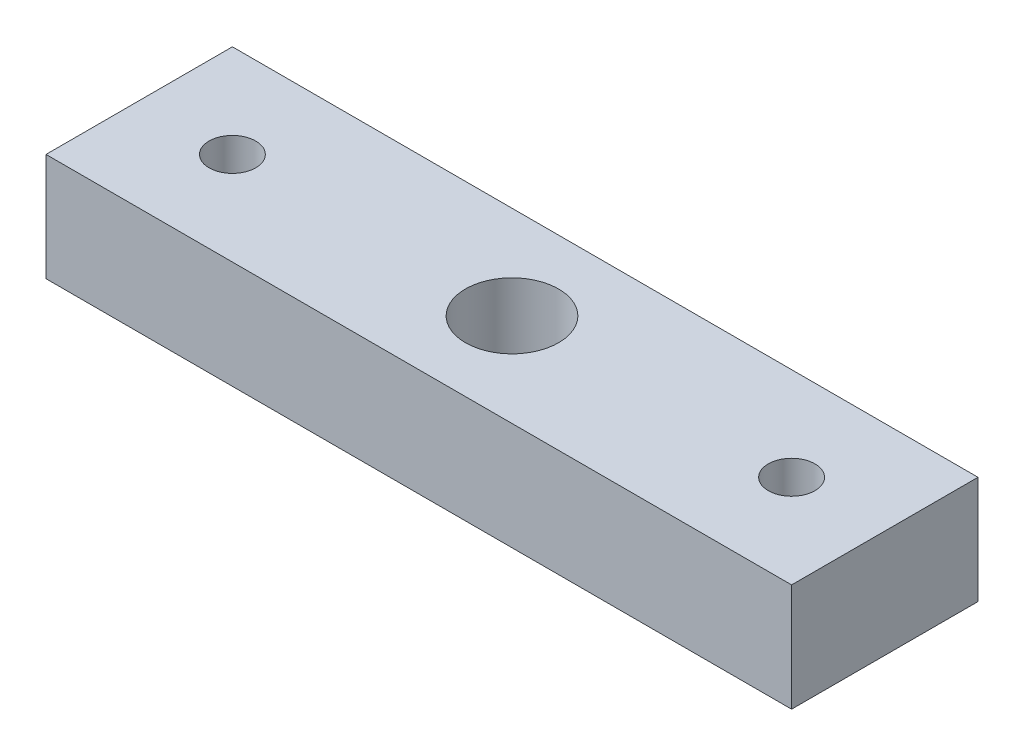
ISO-10303-21;
HEADER;
FILE_DESCRIPTION(('STEP AP214'),'2;1');
FILE_NAME('part.step','',(''),(''),'','','');
FILE_SCHEMA(('AUTOMOTIVE_DESIGN { 1 0 10303 214 1 1 1 1 }'));
ENDSEC;
DATA;
#1=APPLICATION_CONTEXT('core data for automotive mechanical design processes');
#2=APPLICATION_PROTOCOL_DEFINITION('international standard','automotive_design',2000,#1);
#3=PRODUCT_CONTEXT('',#1,'mechanical');
#4=PRODUCT('Part','Part','',(#3));
#5=PRODUCT_RELATED_PRODUCT_CATEGORY('part','',(#4));
#6=PRODUCT_DEFINITION_FORMATION('','',#4);
#7=PRODUCT_DEFINITION_CONTEXT('part definition',#1,'design');
#8=PRODUCT_DEFINITION('design','',#6,#7);
#9=PRODUCT_DEFINITION_SHAPE('','',#8);
#10=(LENGTH_UNIT() NAMED_UNIT(*) SI_UNIT(.MILLI.,.METRE.));
#11=(NAMED_UNIT(*) PLANE_ANGLE_UNIT() SI_UNIT($,.RADIAN.));
#12=(NAMED_UNIT(*) SI_UNIT($,.STERADIAN.) SOLID_ANGLE_UNIT());
#13=UNCERTAINTY_MEASURE_WITH_UNIT(LENGTH_MEASURE(1.E-05),#10,'distance_accuracy_value','');
#14=(GEOMETRIC_REPRESENTATION_CONTEXT(3) GLOBAL_UNCERTAINTY_ASSIGNED_CONTEXT((#13)) GLOBAL_UNIT_ASSIGNED_CONTEXT((#10,
#11,#12)) REPRESENTATION_CONTEXT('',''));
#15=CARTESIAN_POINT('',(0.,0.,0.));
#16=DIRECTION('',(0.,0.,1.));
#17=DIRECTION('',(1.,0.,0.));
#18=AXIS2_PLACEMENT_3D('',#15,#16,#17);
#19=CARTESIAN_POINT('',(0.,58.6848907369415,0.));
#20=DIRECTION('',(0.,-1.,0.));
#21=DIRECTION('',(0.,0.,-1.));
#22=AXIS2_PLACEMENT_3D('',#19,#20,#21);
#23=PLANE('',#22);
#24=DIRECTION('',(0.,0.,-1.));
#25=VECTOR('',#24,1.);
#26=CARTESIAN_POINT('',(203.2,58.6848907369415,50.8));
#27=LINE('',#26,#25);
#28=CARTESIAN_POINT('',(203.2,58.6848907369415,50.8));
#29=VERTEX_POINT('',#28);
#30=CARTESIAN_POINT('',(203.2,58.6848907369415,-50.8));
#31=VERTEX_POINT('',#30);
#32=EDGE_CURVE('E156',#29,#31,#27,.T.);
#33=ORIENTED_EDGE('',*,*,#32,.T.);
#34=DIRECTION('',(-1.,0.,0.));
#35=VECTOR('',#34,1.);
#36=CARTESIAN_POINT('',(-203.2,58.6848907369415,-50.8));
#37=LINE('',#36,#35);
#38=CARTESIAN_POINT('',(-203.2,58.6848907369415,-50.8));
#39=VERTEX_POINT('',#38);
#40=EDGE_CURVE('E93',#31,#39,#37,.T.);
#41=ORIENTED_EDGE('',*,*,#40,.T.);
#42=DIRECTION('',(0.,0.,1.));
#43=VECTOR('',#42,1.);
#44=CARTESIAN_POINT('',(-203.2,58.6848907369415,50.8));
#45=LINE('',#44,#43);
#46=CARTESIAN_POINT('',(-203.2,58.6848907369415,50.8));
#47=VERTEX_POINT('',#46);
#48=EDGE_CURVE('E157',#39,#47,#45,.T.);
#49=ORIENTED_EDGE('',*,*,#48,.T.);
#50=DIRECTION('',(1.,0.,0.));
#51=VECTOR('',#50,1.);
#52=CARTESIAN_POINT('',(-203.2,58.6848907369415,50.8));
#53=LINE('',#52,#51);
#54=EDGE_CURVE('E58',#47,#29,#53,.T.);
#55=ORIENTED_EDGE('',*,*,#54,.T.);
#56=EDGE_LOOP('',(#33,#41,#49,#55));
#57=FACE_BOUND('',#56,.T.);
#58=CARTESIAN_POINT('',(-152.4,58.6848907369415,0.));
#59=DIRECTION('',(0.,1.,0.));
#60=DIRECTION('',(0.,0.,1.));
#61=AXIS2_PLACEMENT_3D('',#58,#59,#60);
#62=CIRCLE('',#61,12.7);
#63=CARTESIAN_POINT('',(-152.4,58.6848907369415,12.7));
#64=VERTEX_POINT('',#63);
#65=EDGE_CURVE('E147',#64,#64,#62,.T.);
#66=ORIENTED_EDGE('',*,*,#65,.F.);
#67=EDGE_LOOP('',(#66));
#68=FACE_BOUND('',#67,.T.);
#69=CARTESIAN_POINT('',(152.4,58.6848907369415,0.));
#70=DIRECTION('',(0.,1.,0.));
#71=DIRECTION('',(0.,0.,1.));
#72=AXIS2_PLACEMENT_3D('',#69,#70,#71);
#73=CIRCLE('',#72,12.7);
#74=CARTESIAN_POINT('',(152.4,58.6848907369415,12.7));
#75=VERTEX_POINT('',#74);
#76=EDGE_CURVE('E145',#75,#75,#73,.T.);
#77=ORIENTED_EDGE('',*,*,#76,.F.);
#78=EDGE_LOOP('',(#77));
#79=FACE_BOUND('',#78,.T.);
#80=CARTESIAN_POINT('',(0.,58.6848907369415,0.));
#81=DIRECTION('',(0.,1.,0.));
#82=DIRECTION('',(0.,0.,1.));
#83=AXIS2_PLACEMENT_3D('',#80,#81,#82);
#84=CIRCLE('',#83,25.4);
#85=CARTESIAN_POINT('',(0.,58.6848907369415,25.4));
#86=VERTEX_POINT('',#85);
#87=EDGE_CURVE('E137',#86,#86,#84,.T.);
#88=ORIENTED_EDGE('',*,*,#87,.F.);
#89=EDGE_LOOP('',(#88));
#90=FACE_BOUND('',#89,.T.);
#91=ADVANCED_FACE('F43',(#57,#68,#79,#90),#23,.F.);
#92=CARTESIAN_POINT('',(0.,0.,0.));
#93=DIRECTION('',(0.,-1.,0.));
#94=DIRECTION('',(0.,0.,-1.));
#95=AXIS2_PLACEMENT_3D('',#92,#93,#94);
#96=PLANE('',#95);
#97=CARTESIAN_POINT('',(-133.35,0.,0.));
#98=DIRECTION('',(0.,-1.,0.));
#99=DIRECTION('',(0.,0.,-1.));
#100=AXIS2_PLACEMENT_3D('',#97,#98,#99);
#101=CIRCLE('',#100,2.55269999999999);
#102=CARTESIAN_POINT('',(-133.35,0.,-2.55269999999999));
#103=VERTEX_POINT('',#102);
#104=EDGE_CURVE('E113',#103,#103,#101,.T.);
#105=ORIENTED_EDGE('',*,*,#104,.F.);
#106=EDGE_LOOP('',(#105));
#107=FACE_BOUND('',#106,.T.);
#108=CARTESIAN_POINT('',(-171.45,0.,0.));
#109=DIRECTION('',(0.,-1.,0.));
#110=DIRECTION('',(0.,0.,-1.));
#111=AXIS2_PLACEMENT_3D('',#108,#109,#110);
#112=CIRCLE('',#111,2.55269999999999);
#113=CARTESIAN_POINT('',(-171.45,0.,-2.55269999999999));
#114=VERTEX_POINT('',#113);
#115=EDGE_CURVE('E111',#114,#114,#112,.T.);
#116=ORIENTED_EDGE('',*,*,#115,.F.);
#117=EDGE_LOOP('',(#116));
#118=FACE_BOUND('',#117,.T.);
#119=CARTESIAN_POINT('',(133.35,0.,0.));
#120=DIRECTION('',(0.,-1.,0.));
#121=DIRECTION('',(0.,0.,-1.));
#122=AXIS2_PLACEMENT_3D('',#119,#120,#121);
#123=CIRCLE('',#122,2.55269999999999);
#124=CARTESIAN_POINT('',(133.35,0.,-2.55269999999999));
#125=VERTEX_POINT('',#124);
#126=EDGE_CURVE('E124',#125,#125,#123,.T.);
#127=ORIENTED_EDGE('',*,*,#126,.F.);
#128=EDGE_LOOP('',(#127));
#129=FACE_BOUND('',#128,.T.);
#130=CARTESIAN_POINT('',(171.45,0.,0.));
#131=DIRECTION('',(0.,-1.,0.));
#132=DIRECTION('',(0.,0.,-1.));
#133=AXIS2_PLACEMENT_3D('',#130,#131,#132);
#134=CIRCLE('',#133,2.55269999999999);
#135=CARTESIAN_POINT('',(171.45,0.,-2.55269999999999));
#136=VERTEX_POINT('',#135);
#137=EDGE_CURVE('E134',#136,#136,#134,.T.);
#138=ORIENTED_EDGE('',*,*,#137,.F.);
#139=EDGE_LOOP('',(#138));
#140=FACE_BOUND('',#139,.T.);
#141=CARTESIAN_POINT('',(152.4,0.,0.));
#142=DIRECTION('',(0.,1.,0.));
#143=DIRECTION('',(0.,0.,1.));
#144=AXIS2_PLACEMENT_3D('',#141,#142,#143);
#145=CIRCLE('',#144,12.7);
#146=CARTESIAN_POINT('',(152.4,0.,12.7));
#147=VERTEX_POINT('',#146);
#148=EDGE_CURVE('E143',#147,#147,#145,.T.);
#149=ORIENTED_EDGE('',*,*,#148,.T.);
#150=EDGE_LOOP('',(#149));
#151=FACE_BOUND('',#150,.T.);
#152=DIRECTION('',(0.,0.,-1.));
#153=VECTOR('',#152,1.);
#154=CARTESIAN_POINT('',(203.2,0.,50.8));
#155=LINE('',#154,#153);
#156=CARTESIAN_POINT('',(203.2,0.,50.8));
#157=VERTEX_POINT('',#156);
#158=CARTESIAN_POINT('',(203.2,0.,-50.8));
#159=VERTEX_POINT('',#158);
#160=EDGE_CURVE('E153',#157,#159,#155,.T.);
#161=ORIENTED_EDGE('',*,*,#160,.F.);
#162=DIRECTION('',(1.,0.,0.));
#163=VECTOR('',#162,1.);
#164=CARTESIAN_POINT('',(-203.2,0.,50.8));
#165=LINE('',#164,#163);
#166=CARTESIAN_POINT('',(-203.2,0.,50.8));
#167=VERTEX_POINT('',#166);
#168=EDGE_CURVE('E83',#167,#157,#165,.T.);
#169=ORIENTED_EDGE('',*,*,#168,.F.);
#170=DIRECTION('',(0.,0.,1.));
#171=VECTOR('',#170,1.);
#172=CARTESIAN_POINT('',(-203.2,0.,50.8));
#173=LINE('',#172,#171);
#174=CARTESIAN_POINT('',(-203.2,0.,-50.8));
#175=VERTEX_POINT('',#174);
#176=EDGE_CURVE('E80',#175,#167,#173,.T.);
#177=ORIENTED_EDGE('',*,*,#176,.F.);
#178=DIRECTION('',(-1.,0.,0.));
#179=VECTOR('',#178,1.);
#180=CARTESIAN_POINT('',(-203.2,0.,-50.8));
#181=LINE('',#180,#179);
#182=EDGE_CURVE('E164',#159,#175,#181,.T.);
#183=ORIENTED_EDGE('',*,*,#182,.F.);
#184=EDGE_LOOP('',(#161,#169,#177,#183));
#185=FACE_BOUND('',#184,.T.);
#186=CARTESIAN_POINT('',(-152.4,0.,0.));
#187=DIRECTION('',(0.,1.,0.));
#188=DIRECTION('',(0.,0.,1.));
#189=AXIS2_PLACEMENT_3D('',#186,#187,#188);
#190=CIRCLE('',#189,12.7);
#191=CARTESIAN_POINT('',(-152.4,0.,12.7));
#192=VERTEX_POINT('',#191);
#193=EDGE_CURVE('E150',#192,#192,#190,.T.);
#194=ORIENTED_EDGE('',*,*,#193,.T.);
#195=EDGE_LOOP('',(#194));
#196=FACE_BOUND('',#195,.T.);
#197=CARTESIAN_POINT('',(0.,0.,0.));
#198=DIRECTION('',(0.,1.,0.));
#199=DIRECTION('',(0.,0.,1.));
#200=AXIS2_PLACEMENT_3D('',#197,#198,#199);
#201=CIRCLE('',#200,25.4);
#202=CARTESIAN_POINT('',(0.,0.,25.4));
#203=VERTEX_POINT('',#202);
#204=EDGE_CURVE('E140',#203,#203,#201,.T.);
#205=ORIENTED_EDGE('',*,*,#204,.T.);
#206=EDGE_LOOP('',(#205));
#207=FACE_BOUND('',#206,.T.);
#208=ADVANCED_FACE('F172',(#107,#118,#129,#140,#151,#185,#196,#207),#96,.T.);
#209=CARTESIAN_POINT('',(203.2,58.6848907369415,50.8));
#210=DIRECTION('',(-1.,0.,0.));
#211=DIRECTION('',(0.,0.,1.));
#212=AXIS2_PLACEMENT_3D('',#209,#210,#211);
#213=PLANE('',#212);
#214=ORIENTED_EDGE('',*,*,#160,.T.);
#215=DIRECTION('',(0.,-1.,0.));
#216=VECTOR('',#215,1.);
#217=CARTESIAN_POINT('',(203.2,58.6848907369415,-50.8));
#218=LINE('',#217,#216);
#219=EDGE_CURVE('E11',#31,#159,#218,.T.);
#220=ORIENTED_EDGE('',*,*,#219,.F.);
#221=ORIENTED_EDGE('',*,*,#32,.F.);
#222=DIRECTION('',(0.,-1.,0.));
#223=VECTOR('',#222,1.);
#224=CARTESIAN_POINT('',(203.2,58.6848907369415,50.8));
#225=LINE('',#224,#223);
#226=EDGE_CURVE('E165',#29,#157,#225,.T.);
#227=ORIENTED_EDGE('',*,*,#226,.T.);
#228=EDGE_LOOP('',(#214,#220,#221,#227));
#229=FACE_BOUND('',#228,.T.);
#230=ADVANCED_FACE('F44',(#229),#213,.F.);
#231=CARTESIAN_POINT('',(-203.2,58.6848907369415,-50.8));
#232=DIRECTION('',(0.,0.,1.));
#233=DIRECTION('',(1.,0.,0.));
#234=AXIS2_PLACEMENT_3D('',#231,#232,#233);
#235=PLANE('',#234);
#236=ORIENTED_EDGE('',*,*,#182,.T.);
#237=DIRECTION('',(0.,-1.,0.));
#238=VECTOR('',#237,1.);
#239=CARTESIAN_POINT('',(-203.2,58.6848907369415,-50.8));
#240=LINE('',#239,#238);
#241=EDGE_CURVE('E55',#39,#175,#240,.T.);
#242=ORIENTED_EDGE('',*,*,#241,.F.);
#243=ORIENTED_EDGE('',*,*,#40,.F.);
#244=ORIENTED_EDGE('',*,*,#219,.T.);
#245=EDGE_LOOP('',(#236,#242,#243,#244));
#246=FACE_BOUND('',#245,.T.);
#247=ADVANCED_FACE('F191',(#246),#235,.F.);
#248=CARTESIAN_POINT('',(-203.2,58.6848907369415,50.8));
#249=DIRECTION('',(1.,0.,0.));
#250=DIRECTION('',(0.,0.,-1.));
#251=AXIS2_PLACEMENT_3D('',#248,#249,#250);
#252=PLANE('',#251);
#253=ORIENTED_EDGE('',*,*,#176,.T.);
#254=DIRECTION('',(0.,-1.,0.));
#255=VECTOR('',#254,1.);
#256=CARTESIAN_POINT('',(-203.2,58.6848907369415,50.8));
#257=LINE('',#256,#255);
#258=EDGE_CURVE('E168',#47,#167,#257,.T.);
#259=ORIENTED_EDGE('',*,*,#258,.F.);
#260=ORIENTED_EDGE('',*,*,#48,.F.);
#261=ORIENTED_EDGE('',*,*,#241,.T.);
#262=EDGE_LOOP('',(#253,#259,#260,#261));
#263=FACE_BOUND('',#262,.T.);
#264=ADVANCED_FACE('F171',(#263),#252,.F.);
#265=CARTESIAN_POINT('',(-203.2,58.6848907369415,50.8));
#266=DIRECTION('',(0.,0.,-1.));
#267=DIRECTION('',(-1.,0.,0.));
#268=AXIS2_PLACEMENT_3D('',#265,#266,#267);
#269=PLANE('',#268);
#270=ORIENTED_EDGE('',*,*,#168,.T.);
#271=ORIENTED_EDGE('',*,*,#226,.F.);
#272=ORIENTED_EDGE('',*,*,#54,.F.);
#273=ORIENTED_EDGE('',*,*,#258,.T.);
#274=EDGE_LOOP('',(#270,#271,#272,#273));
#275=FACE_BOUND('',#274,.T.);
#276=ADVANCED_FACE('F179',(#275),#269,.F.);
#277=CARTESIAN_POINT('',(-152.4,58.6848907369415,0.));
#278=DIRECTION('',(0.,-1.,0.));
#279=DIRECTION('',(0.,0.,-1.));
#280=AXIS2_PLACEMENT_3D('',#277,#278,#279);
#281=CYLINDRICAL_SURFACE('',#280,12.7);
#282=ORIENTED_EDGE('',*,*,#65,.T.);
#283=EDGE_LOOP('',(#282));
#284=FACE_BOUND('',#283,.T.);
#285=ORIENTED_EDGE('',*,*,#193,.F.);
#286=EDGE_LOOP('',(#285));
#287=FACE_BOUND('',#286,.T.);
#288=ADVANCED_FACE('F185',(#284,#287),#281,.F.);
#289=CARTESIAN_POINT('',(152.4,58.6848907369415,0.));
#290=DIRECTION('',(0.,-1.,0.));
#291=DIRECTION('',(0.,0.,-1.));
#292=AXIS2_PLACEMENT_3D('',#289,#290,#291);
#293=CYLINDRICAL_SURFACE('',#292,12.7);
#294=ORIENTED_EDGE('',*,*,#76,.T.);
#295=EDGE_LOOP('',(#294));
#296=FACE_BOUND('',#295,.T.);
#297=ORIENTED_EDGE('',*,*,#148,.F.);
#298=EDGE_LOOP('',(#297));
#299=FACE_BOUND('',#298,.T.);
#300=ADVANCED_FACE('F190',(#296,#299),#293,.F.);
#301=CARTESIAN_POINT('',(0.,58.6848907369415,0.));
#302=DIRECTION('',(0.,-1.,0.));
#303=DIRECTION('',(0.,0.,-1.));
#304=AXIS2_PLACEMENT_3D('',#301,#302,#303);
#305=CYLINDRICAL_SURFACE('',#304,25.4);
#306=ORIENTED_EDGE('',*,*,#87,.T.);
#307=EDGE_LOOP('',(#306));
#308=FACE_BOUND('',#307,.T.);
#309=ORIENTED_EDGE('',*,*,#204,.F.);
#310=EDGE_LOOP('',(#309));
#311=FACE_BOUND('',#310,.T.);
#312=ADVANCED_FACE('F202',(#308,#311),#305,.F.);
#313=CARTESIAN_POINT('',(171.45,31.75,0.));
#314=DIRECTION('',(0.,-1.,0.));
#315=DIRECTION('',(0.,0.,-1.));
#316=AXIS2_PLACEMENT_3D('',#313,#314,#315);
#317=CONICAL_SURFACE('',#316,2.55269999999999,1.02974425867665);
#318=CARTESIAN_POINT('',(171.45,33.2838169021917,0.));
#319=VERTEX_POINT('',#318);
#320=VERTEX_LOOP('',#319);
#321=FACE_BOUND('',#320,.T.);
#322=CARTESIAN_POINT('',(171.45,31.75,0.));
#323=DIRECTION('',(0.,-1.,0.));
#324=DIRECTION('',(0.,0.,-1.));
#325=AXIS2_PLACEMENT_3D('',#322,#323,#324);
#326=CIRCLE('',#325,2.55269999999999);
#327=CARTESIAN_POINT('',(171.45,31.75,-2.55269999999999));
#328=VERTEX_POINT('',#327);
#329=EDGE_CURVE('E133',#328,#328,#326,.T.);
#330=ORIENTED_EDGE('',*,*,#329,.T.);
#331=EDGE_LOOP('',(#330));
#332=FACE_BOUND('',#331,.T.);
#333=ADVANCED_FACE('F207',(#321,#332),#317,.F.);
#334=CARTESIAN_POINT('',(171.45,0.,0.));
#335=DIRECTION('',(0.,-1.,0.));
#336=DIRECTION('',(0.,0.,-1.));
#337=AXIS2_PLACEMENT_3D('',#334,#335,#336);
#338=CYLINDRICAL_SURFACE('',#337,2.55269999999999);
#339=ORIENTED_EDGE('',*,*,#329,.F.);
#340=EDGE_LOOP('',(#339));
#341=FACE_BOUND('',#340,.T.);
#342=ORIENTED_EDGE('',*,*,#137,.T.);
#343=EDGE_LOOP('',(#342));
#344=FACE_BOUND('',#343,.T.);
#345=ADVANCED_FACE('F213',(#341,#344),#338,.F.);
#346=CARTESIAN_POINT('',(133.35,31.75,0.));
#347=DIRECTION('',(0.,-1.,0.));
#348=DIRECTION('',(0.,0.,-1.));
#349=AXIS2_PLACEMENT_3D('',#346,#347,#348);
#350=CONICAL_SURFACE('',#349,2.55269999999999,1.02974425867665);
#351=CARTESIAN_POINT('',(133.35,33.2838169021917,0.));
#352=VERTEX_POINT('',#351);
#353=VERTEX_LOOP('',#352);
#354=FACE_BOUND('',#353,.T.);
#355=CARTESIAN_POINT('',(133.35,31.75,0.));
#356=DIRECTION('',(0.,-1.,0.));
#357=DIRECTION('',(0.,0.,-1.));
#358=AXIS2_PLACEMENT_3D('',#355,#356,#357);
#359=CIRCLE('',#358,2.55269999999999);
#360=CARTESIAN_POINT('',(133.35,31.75,-2.55269999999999));
#361=VERTEX_POINT('',#360);
#362=EDGE_CURVE('E126',#361,#361,#359,.T.);
#363=ORIENTED_EDGE('',*,*,#362,.T.);
#364=EDGE_LOOP('',(#363));
#365=FACE_BOUND('',#364,.T.);
#366=ADVANCED_FACE('F220',(#354,#365),#350,.F.);
#367=CARTESIAN_POINT('',(133.35,0.,0.));
#368=DIRECTION('',(0.,-1.,0.));
#369=DIRECTION('',(0.,0.,-1.));
#370=AXIS2_PLACEMENT_3D('',#367,#368,#369);
#371=CYLINDRICAL_SURFACE('',#370,2.55269999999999);
#372=ORIENTED_EDGE('',*,*,#362,.F.);
#373=EDGE_LOOP('',(#372));
#374=FACE_BOUND('',#373,.T.);
#375=ORIENTED_EDGE('',*,*,#126,.T.);
#376=EDGE_LOOP('',(#375));
#377=FACE_BOUND('',#376,.T.);
#378=ADVANCED_FACE('F222',(#374,#377),#371,.F.);
#379=CARTESIAN_POINT('',(-171.45,31.75,0.));
#380=DIRECTION('',(0.,-1.,0.));
#381=DIRECTION('',(0.,0.,-1.));
#382=AXIS2_PLACEMENT_3D('',#379,#380,#381);
#383=CONICAL_SURFACE('',#382,2.55269999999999,1.02974425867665);
#384=CARTESIAN_POINT('',(-171.45,33.2838169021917,0.));
#385=VERTEX_POINT('',#384);
#386=VERTEX_LOOP('',#385);
#387=FACE_BOUND('',#386,.T.);
#388=CARTESIAN_POINT('',(-171.45,31.75,0.));
#389=DIRECTION('',(0.,-1.,0.));
#390=DIRECTION('',(0.,0.,-1.));
#391=AXIS2_PLACEMENT_3D('',#388,#389,#390);
#392=CIRCLE('',#391,2.55269999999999);
#393=CARTESIAN_POINT('',(-171.45,31.75,-2.55269999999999));
#394=VERTEX_POINT('',#393);
#395=EDGE_CURVE('E120',#394,#394,#392,.T.);
#396=ORIENTED_EDGE('',*,*,#395,.T.);
#397=EDGE_LOOP('',(#396));
#398=FACE_BOUND('',#397,.T.);
#399=ADVANCED_FACE('F223',(#387,#398),#383,.F.);
#400=CARTESIAN_POINT('',(-171.45,0.,0.));
#401=DIRECTION('',(0.,-1.,0.));
#402=DIRECTION('',(0.,0.,-1.));
#403=AXIS2_PLACEMENT_3D('',#400,#401,#402);
#404=CYLINDRICAL_SURFACE('',#403,2.55269999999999);
#405=ORIENTED_EDGE('',*,*,#395,.F.);
#406=EDGE_LOOP('',(#405));
#407=FACE_BOUND('',#406,.T.);
#408=ORIENTED_EDGE('',*,*,#115,.T.);
#409=EDGE_LOOP('',(#408));
#410=FACE_BOUND('',#409,.T.);
#411=ADVANCED_FACE('F107',(#407,#410),#404,.F.);
#412=CARTESIAN_POINT('',(-133.35,31.75,0.));
#413=DIRECTION('',(0.,-1.,0.));
#414=DIRECTION('',(0.,0.,-1.));
#415=AXIS2_PLACEMENT_3D('',#412,#413,#414);
#416=CONICAL_SURFACE('',#415,2.55269999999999,1.02974425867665);
#417=CARTESIAN_POINT('',(-133.35,33.2838169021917,0.));
#418=VERTEX_POINT('',#417);
#419=VERTEX_LOOP('',#418);
#420=FACE_BOUND('',#419,.T.);
#421=CARTESIAN_POINT('',(-133.35,31.75,0.));
#422=DIRECTION('',(0.,-1.,0.));
#423=DIRECTION('',(0.,0.,-1.));
#424=AXIS2_PLACEMENT_3D('',#421,#422,#423);
#425=CIRCLE('',#424,2.55269999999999);
#426=CARTESIAN_POINT('',(-133.35,31.75,-2.55269999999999));
#427=VERTEX_POINT('',#426);
#428=EDGE_CURVE('E115',#427,#427,#425,.T.);
#429=ORIENTED_EDGE('',*,*,#428,.T.);
#430=EDGE_LOOP('',(#429));
#431=FACE_BOUND('',#430,.T.);
#432=ADVANCED_FACE('F102',(#420,#431),#416,.F.);
#433=CARTESIAN_POINT('',(-133.35,0.,0.));
#434=DIRECTION('',(0.,-1.,0.));
#435=DIRECTION('',(0.,0.,-1.));
#436=AXIS2_PLACEMENT_3D('',#433,#434,#435);
#437=CYLINDRICAL_SURFACE('',#436,2.55269999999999);
#438=ORIENTED_EDGE('',*,*,#428,.F.);
#439=EDGE_LOOP('',(#438));
#440=FACE_BOUND('',#439,.T.);
#441=ORIENTED_EDGE('',*,*,#104,.T.);
#442=EDGE_LOOP('',(#441));
#443=FACE_BOUND('',#442,.T.);
#444=ADVANCED_FACE('F110',(#440,#443),#437,.F.);
#445=CLOSED_SHELL('',(#91,#208,#230,#247,#264,#276,#288,#300,#312,#333,#345,#366,#378,#399,#411,
#432,#444));
#446=MANIFOLD_SOLID_BREP('B2',#445);
#447=ADVANCED_BREP_SHAPE_REPRESENTATION('',(#18,#446),#14);
#448=SHAPE_DEFINITION_REPRESENTATION(#9,#447);
ENDSEC;
END-ISO-10303-21;
